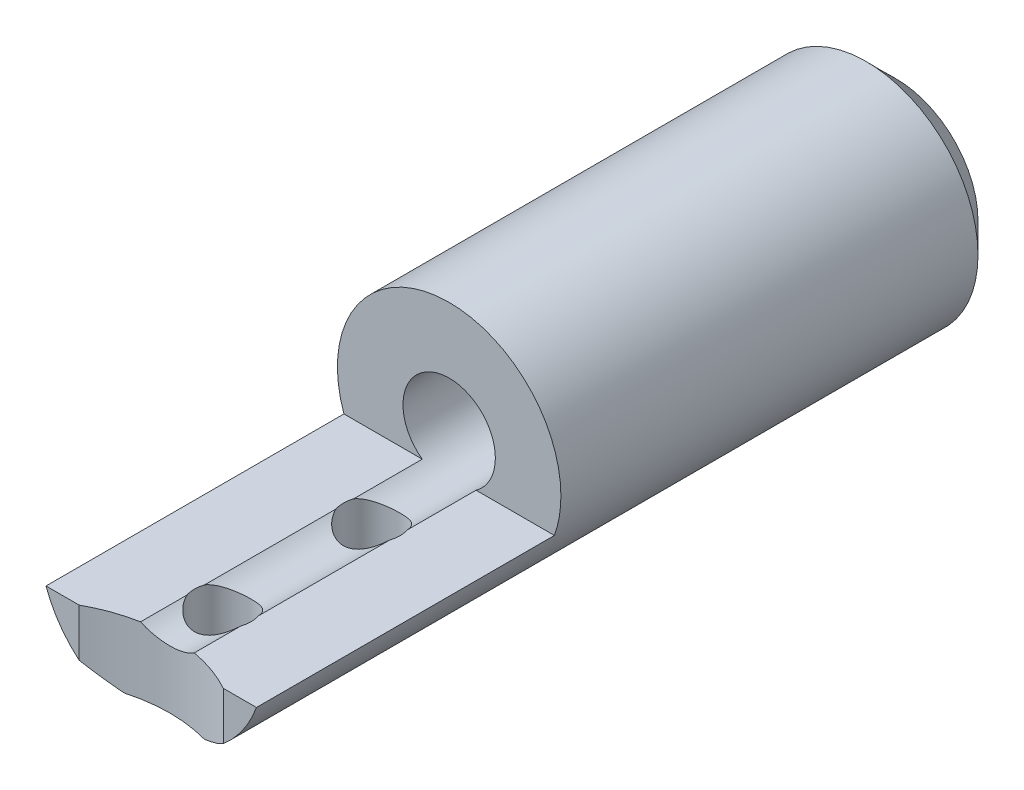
from build123d import *

# Parameters (mm, degrees)
SKETCH1_R          = 9.525
SKETCH1_R_2        = 3.937
EXTRUDE1_DEPTH     = 63.5
CUT_EXTRUDE1_DEPTH = 25.4
CUT_EXTRUDE2_DEPTH = 25.4
SKETCH4_R          = 2.413
SKETCH4_R_2        = 1.8923
CUT_EXTRUDE3_DEPTH = 6.35
CHAMFER2_SIZE      = 2.54
SKETCH5_R          = 12.7
CUT_EXTRUDE4_DEPTH = 67.79886128


with BuildPart() as part:
    # Sketch1 → Extrude1 (new body)
    with BuildSketch(Plane.XY):
        Circle(SKETCH1_R)
        Circle(SKETCH1_R_2, mode=Mode.SUBTRACT)
    extrude(amount=-EXTRUDE1_DEPTH)

    # Sketch2 → Cut-Extrude1 (cut)
    with BuildSketch(Plane.XY):
        with BuildLine():
            Line((-9.525, -3.2004), (9.525, -3.2004))
            Line((9.525, -3.2004), (9.525, 3.2004))
            ThreePointArc((9.525, 3.2004), (0, 10.329891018), (-9.525, 3.2004))
            Line((-9.525, 3.2004), (-9.525, -3.2004))
        make_face()
    extrude(amount=-CUT_EXTRUDE1_DEPTH, mode=Mode.SUBTRACT)

    # Sketch3 → Cut-Extrude2 (cut)
    with BuildSketch(Plane.XY):
        Polygon((0, -9.525), (6.594230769, -9.525), (6.594230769, -8.89), (-6.187179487, -8.89), (-6.187179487, -9.525), align=None)
    extrude(amount=-CUT_EXTRUDE2_DEPTH, mode=Mode.SUBTRACT)

    # Sketch4 → Cut-Extrude3 (cut, symmetric)
    with BuildSketch(Plane.XZ.offset(8.89)):
        with Locations(Location((0, -6.096, 0), (0, 0, 198.152695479))):
            Circle(SKETCH4_R)
        with Locations(Location((0, -18.796, 0), (0, 0, 198.152695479))):
            Circle(SKETCH4_R)
        with Locations(Location((0, -38.995512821, 0), (0, 0, 270))):
            Circle(SKETCH4_R_2)
        with Locations(Location((0, -51.695512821, 0), (0, 0, 270))):
            Circle(SKETCH4_R_2)
    extrude(amount=CUT_EXTRUDE3_DEPTH, both=True, mode=Mode.SUBTRACT)

    # Chamfer2
    chamfer2_edges = [part.edges().sort_by_distance(p)[0] for p in [
        (-9.525, 0, -63.5),
    ]]
    chamfer(chamfer2_edges, length=CHAMFER2_SIZE)

    # Sketch5 → Cut-Extrude4 (cut, through all)
    with BuildSketch(Plane.XZ.offset(8.89)):
        with Locations((0, 11.1125)):
            Circle(SKETCH5_R)
    extrude(amount=-CUT_EXTRUDE4_DEPTH, mode=Mode.SUBTRACT)


solid = part.part
